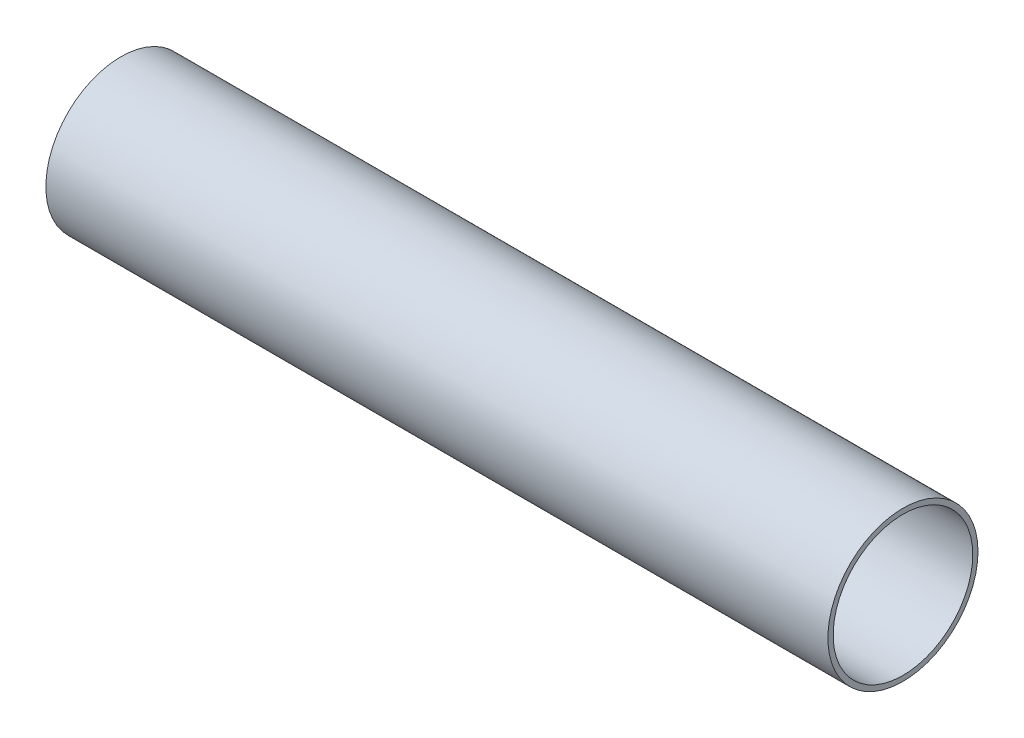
from build123d import *

# Parameters (mm, degrees)
SKETCH1_R      = 29.083
SKETCH1_R_2    = 27.051
EXTRUDE1_DEPTH = 303.022


with BuildPart() as part:
    # Sketch1 → Extrude1 (new body)
    with BuildSketch(Plane(origin=(0, 0, 0), x_dir=(0, 0, -1), z_dir=(1, 0, 0))):
        Circle(SKETCH1_R)
        Circle(SKETCH1_R_2, mode=Mode.SUBTRACT)
    extrude(amount=EXTRUDE1_DEPTH)


solid = part.part
